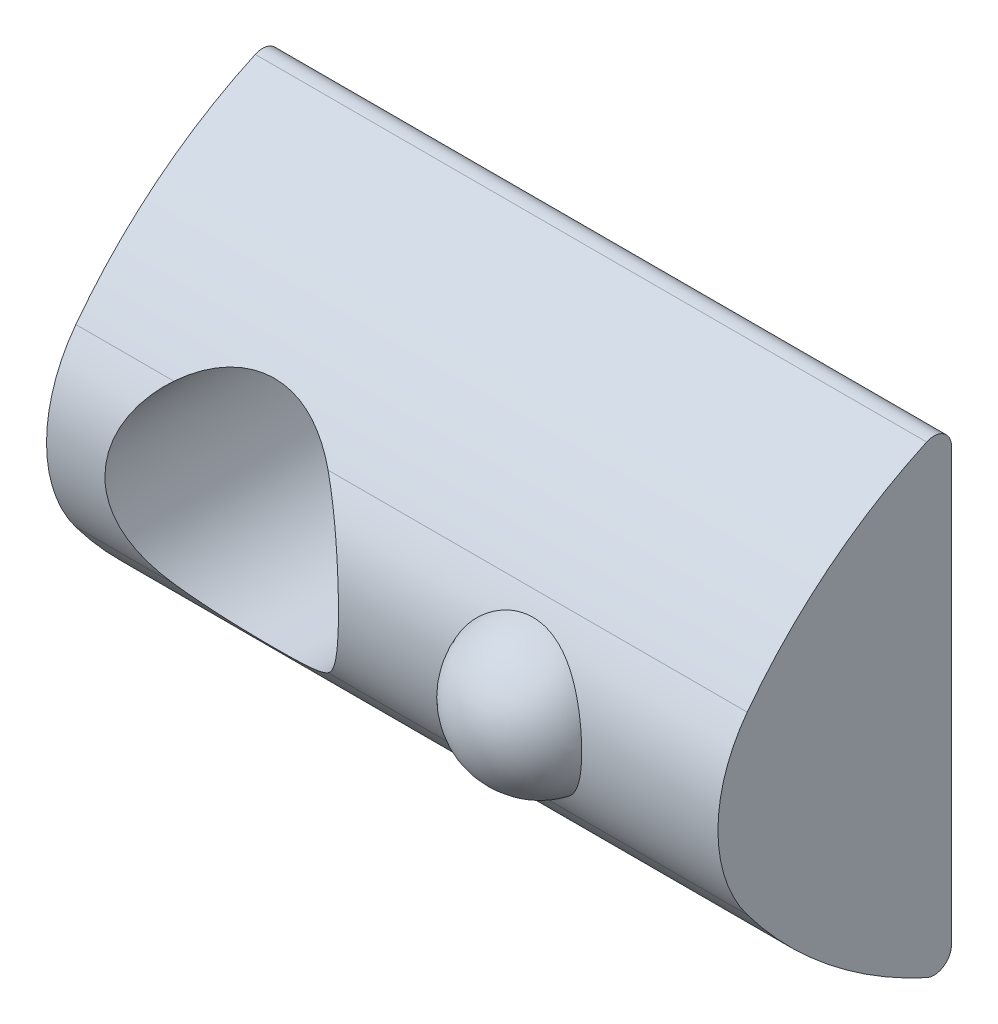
ISO-10303-21;
HEADER;
FILE_DESCRIPTION(('STEP AP214'),'2;1');
FILE_NAME('part.step','',(''),(''),'','','');
FILE_SCHEMA(('AUTOMOTIVE_DESIGN { 1 0 10303 214 1 1 1 1 }'));
ENDSEC;
DATA;
#1=APPLICATION_CONTEXT('core data for automotive mechanical design processes');
#2=APPLICATION_PROTOCOL_DEFINITION('international standard','automotive_design',2000,#1);
#3=PRODUCT_CONTEXT('',#1,'mechanical');
#4=PRODUCT('Part','Part','',(#3));
#5=PRODUCT_RELATED_PRODUCT_CATEGORY('part','',(#4));
#6=PRODUCT_DEFINITION_FORMATION('','',#4);
#7=PRODUCT_DEFINITION_CONTEXT('part definition',#1,'design');
#8=PRODUCT_DEFINITION('design','',#6,#7);
#9=PRODUCT_DEFINITION_SHAPE('','',#8);
#10=(LENGTH_UNIT() NAMED_UNIT(*) SI_UNIT(.MILLI.,.METRE.));
#11=(NAMED_UNIT(*) PLANE_ANGLE_UNIT() SI_UNIT($,.RADIAN.));
#12=(NAMED_UNIT(*) SI_UNIT($,.STERADIAN.) SOLID_ANGLE_UNIT());
#13=UNCERTAINTY_MEASURE_WITH_UNIT(LENGTH_MEASURE(1.E-05),#10,'distance_accuracy_value','');
#14=(GEOMETRIC_REPRESENTATION_CONTEXT(3) GLOBAL_UNCERTAINTY_ASSIGNED_CONTEXT((#13)) GLOBAL_UNIT_ASSIGNED_CONTEXT((#10,
#11,#12)) REPRESENTATION_CONTEXT('',''));
#15=CARTESIAN_POINT('',(0.,0.,0.));
#16=DIRECTION('',(0.,0.,1.));
#17=DIRECTION('',(1.,0.,0.));
#18=AXIS2_PLACEMENT_3D('',#15,#16,#17);
#19=CARTESIAN_POINT('',(-6.5,0.,1.50000071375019));
#20=DIRECTION('',(1.,0.,0.));
#21=DIRECTION('',(0.,0.,1.));
#22=AXIS2_PLACEMENT_3D('',#19,#20,#21);
#23=CYLINDRICAL_SURFACE('',#22,2.49999928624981);
#24=DIRECTION('',(1.,0.,0.));
#25=VECTOR('',#24,1.);
#26=CARTESIAN_POINT('',(-6.5,1.50268008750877,3.497986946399));
#27=LINE('',#26,#25);
#28=CARTESIAN_POINT('',(1.31983050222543,1.50268008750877,3.497986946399));
#29=VERTEX_POINT('',#28);
#30=CARTESIAN_POINT('',(8.5,1.50268008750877,3.497986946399));
#31=VERTEX_POINT('',#30);
#32=EDGE_CURVE('E104',#29,#31,#27,.T.);
#33=ORIENTED_EDGE('',*,*,#32,.F.);
#34=CARTESIAN_POINT('',(1.31983050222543,1.50268008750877,3.497986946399));
#35=CARTESIAN_POINT('',(1.36032086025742,1.46710021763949,3.52474503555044));
#36=CARTESIAN_POINT('',(1.39945364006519,1.42984354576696,3.55127739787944));
#37=CARTESIAN_POINT('',(1.47489622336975,1.351902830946,3.60346503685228));
#38=CARTESIAN_POINT('',(1.51120257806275,1.31121472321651,3.62911922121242));
#39=CARTESIAN_POINT('',(1.61601232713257,1.18349795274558,3.70433937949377));
#40=CARTESIAN_POINT('',(1.67989665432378,1.09126017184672,3.75181725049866));
#41=CARTESIAN_POINT('',(1.78282845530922,0.911219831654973,3.82971285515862));
#42=CARTESIAN_POINT('',(1.8242638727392,0.825443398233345,3.86166171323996));
#43=CARTESIAN_POINT('',(1.89502792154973,0.646585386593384,3.91674082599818));
#44=CARTESIAN_POINT('',(1.92439204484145,0.553526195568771,3.93989691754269));
#45=CARTESIAN_POINT('',(1.96957083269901,0.361380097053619,3.97568510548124));
#46=CARTESIAN_POINT('',(1.98527991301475,0.262252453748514,3.98823517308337));
#47=CARTESIAN_POINT('',(2.00156263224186,0.0619180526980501,4.00124510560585));
#48=CARTESIAN_POINT('',(2.00213442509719,-0.0392889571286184,4.00170349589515));
#49=CARTESIAN_POINT('',(1.98891129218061,-0.228443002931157,3.99113584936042));
#50=CARTESIAN_POINT('',(1.97674695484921,-0.316586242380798,3.9814132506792));
#51=CARTESIAN_POINT('',(1.94127311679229,-0.489092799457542,3.95324794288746));
#52=CARTESIAN_POINT('',(1.91796664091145,-0.573457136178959,3.93480760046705));
#53=CARTESIAN_POINT('',(1.86053007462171,-0.739162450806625,3.88982052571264));
#54=CARTESIAN_POINT('',(1.82608970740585,-0.820331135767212,3.86304233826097));
#55=CARTESIAN_POINT('',(1.74800273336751,-0.975737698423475,3.80323410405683));
#56=CARTESIAN_POINT('',(1.70434135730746,-1.0499641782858,3.77019403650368));
#57=CARTESIAN_POINT('',(1.60805607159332,-1.19236225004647,3.69880738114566));
#58=CARTESIAN_POINT('',(1.55525046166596,-1.26035713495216,3.66035695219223));
#59=CARTESIAN_POINT('',(1.44260174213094,-1.38782764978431,3.58076495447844));
#60=CARTESIAN_POINT('',(1.38279254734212,-1.44734147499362,3.5396367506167));
#61=CARTESIAN_POINT('',(1.31983050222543,-1.50268008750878,3.497986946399));
#62=B_SPLINE_CURVE_WITH_KNOTS('',3,(#34,#35,#36,#37,#38,#39,#40,#41,#42,#43,#44,#45,#46,#47,#48,
#49,#50,#51,#52,#53,#54,#55,#56,#57,#58,#59,#60,#61),.UNSPECIFIED.,.F.,.F.,(4,2,2,2,2,2,2,2,2,2,
2,2,2,4),(0.,0.180442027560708,0.361100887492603,0.724671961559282,1.02491253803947,
1.32426392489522,1.62590989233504,1.92759264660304,2.19487904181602,2.46209291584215,
2.73750905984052,3.0133697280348,3.29552205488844,3.57636055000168),.UNSPECIFIED.);
#63=CARTESIAN_POINT('',(1.31983050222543,-1.50268008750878,3.497986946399));
#64=VERTEX_POINT('',#63);
#65=EDGE_CURVE('E33',#29,#64,#62,.T.);
#66=ORIENTED_EDGE('',*,*,#65,.T.);
#67=DIRECTION('',(1.,0.,0.));
#68=VECTOR('',#67,1.);
#69=CARTESIAN_POINT('',(-6.5,-1.50268008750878,3.497986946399));
#70=LINE('',#69,#68);
#71=CARTESIAN_POINT('',(8.5,-1.50268008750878,3.497986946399));
#72=VERTEX_POINT('',#71);
#73=EDGE_CURVE('E103',#64,#72,#70,.T.);
#74=ORIENTED_EDGE('',*,*,#73,.T.);
#75=CARTESIAN_POINT('',(8.5,0.,1.50000071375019));
#76=DIRECTION('',(-1.,0.,0.));
#77=DIRECTION('',(0.,0.,-1.));
#78=AXIS2_PLACEMENT_3D('',#75,#76,#77);
#79=CIRCLE('',#78,2.49999928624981);
#80=EDGE_CURVE('E115',#72,#31,#79,.T.);
#81=ORIENTED_EDGE('',*,*,#80,.T.);
#82=EDGE_LOOP('',(#33,#66,#74,#81));
#83=FACE_BOUND('',#82,.T.);
#84=CARTESIAN_POINT('',(3.83380961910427,0.,4.00000000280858));
#85=CARTESIAN_POINT('',(3.83381173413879,-0.069863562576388,3.99999625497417));
#86=CARTESIAN_POINT('',(3.83896952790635,-0.139786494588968,3.99704452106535));
#87=CARTESIAN_POINT('',(3.8595455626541,-0.277693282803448,3.98549605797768));
#88=CARTESIAN_POINT('',(3.87497811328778,-0.345674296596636,3.97689145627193));
#89=CARTESIAN_POINT('',(3.9158759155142,-0.477654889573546,3.95485558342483));
#90=CARTESIAN_POINT('',(3.94133160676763,-0.541658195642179,3.94142891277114));
#91=CARTESIAN_POINT('',(4.00191588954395,-0.663979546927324,3.91103821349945));
#92=CARTESIAN_POINT('',(4.0370429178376,-0.722298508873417,3.89407475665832));
#93=CARTESIAN_POINT('',(4.1166880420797,-0.831992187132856,3.85820678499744));
#94=CARTESIAN_POINT('',(4.16125713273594,-0.883326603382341,3.83929202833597));
#95=CARTESIAN_POINT('',(4.25894691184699,-0.977217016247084,3.80165360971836));
#96=CARTESIAN_POINT('',(4.31206779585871,-1.01977281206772,3.78292995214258));
#97=CARTESIAN_POINT('',(4.4242005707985,-1.09373829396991,3.74841316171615));
#98=CARTESIAN_POINT('',(4.48300967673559,-1.12542292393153,3.73255346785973));
#99=CARTESIAN_POINT('',(4.60616471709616,-1.17812160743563,3.70520283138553));
#100=CARTESIAN_POINT('',(4.67050616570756,-1.1991442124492,3.69370838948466));
#101=CARTESIAN_POINT('',(4.79674874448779,-1.22833870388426,3.67748447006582));
#102=CARTESIAN_POINT('',(4.85835873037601,-1.23748645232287,3.6722446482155));
#103=CARTESIAN_POINT('',(4.98245984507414,-1.24590177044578,3.66743057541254));
#104=CARTESIAN_POINT('',(5.04495055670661,-1.24517387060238,3.66785372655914));
#105=CARTESIAN_POINT('',(5.1642800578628,-1.2342849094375,3.67406789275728));
#106=CARTESIAN_POINT('',(5.22120321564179,-1.22480284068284,3.67947248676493));
#107=CARTESIAN_POINT('',(5.33247747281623,-1.19767062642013,3.69449830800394));
#108=CARTESIAN_POINT('',(5.38682836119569,-1.18001981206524,3.7041198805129));
#109=CARTESIAN_POINT('',(5.49292557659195,-1.13654941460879,3.72685129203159));
#110=CARTESIAN_POINT('',(5.54457951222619,-1.11054595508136,3.74003847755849));
#111=CARTESIAN_POINT('',(5.64284138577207,-1.05119703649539,3.76849408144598));
#112=CARTESIAN_POINT('',(5.68944764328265,-1.01784914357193,3.78376318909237));
#113=CARTESIAN_POINT('',(5.7807539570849,-0.941322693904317,3.81641683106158));
#114=CARTESIAN_POINT('',(5.82491950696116,-0.897535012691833,3.83386894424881));
#115=CARTESIAN_POINT('',(5.90573718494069,-0.803230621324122,3.86798126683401));
#116=CARTESIAN_POINT('',(5.94238655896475,-0.752711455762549,3.88464118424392));
#117=CARTESIAN_POINT('',(6.0100728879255,-0.642228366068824,3.91683335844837));
#118=CARTESIAN_POINT('',(6.04050793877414,-0.581844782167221,3.9321955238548));
#119=CARTESIAN_POINT('',(6.09175506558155,-0.456281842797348,3.95884657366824));
#120=CARTESIAN_POINT('',(6.11256610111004,-0.391101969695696,3.97013501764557));
#121=CARTESIAN_POINT('',(6.1445393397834,-0.256614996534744,3.98773385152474));
#122=CARTESIAN_POINT('',(6.15553806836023,-0.187257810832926,3.9939597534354));
#123=CARTESIAN_POINT('',(6.16713711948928,-0.0474061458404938,4.00053049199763));
#124=CARTESIAN_POINT('',(6.1677378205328,0.0230882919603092,4.00087554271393));
#125=CARTESIAN_POINT('',(6.15857558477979,0.162543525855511,3.99567738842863));
#126=CARTESIAN_POINT('',(6.14890521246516,0.231512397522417,3.99018677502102));
#127=CARTESIAN_POINT('',(6.11948257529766,0.366614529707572,3.97390871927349));
#128=CARTESIAN_POINT('',(6.09973004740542,0.432747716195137,3.96312113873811));
#129=CARTESIAN_POINT('',(6.05033743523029,0.560562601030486,3.9372190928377));
#130=CARTESIAN_POINT('',(6.02066520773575,0.622229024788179,3.92209058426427));
#131=CARTESIAN_POINT('',(5.95185948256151,0.7392084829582,3.8889890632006));
#132=CARTESIAN_POINT('',(5.91272449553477,0.794520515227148,3.87101560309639));
#133=CARTESIAN_POINT('',(5.82533093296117,0.897567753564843,3.83396437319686));
#134=CARTESIAN_POINT('',(5.77702203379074,0.945258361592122,3.81488093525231));
#135=CARTESIAN_POINT('',(5.67228326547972,1.03128393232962,3.77786109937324));
#136=CARTESIAN_POINT('',(5.61585480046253,1.06962050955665,3.75992450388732));
#137=CARTESIAN_POINT('',(5.4986746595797,1.13429301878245,3.72814473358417));
#138=CARTESIAN_POINT('',(5.438201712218,1.16106303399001,3.71416195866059));
#139=CARTESIAN_POINT('',(5.31268810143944,1.20387429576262,3.69118362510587));
#140=CARTESIAN_POINT('',(5.24765137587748,1.21992466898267,3.68218382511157));
#141=CARTESIAN_POINT('',(5.12152058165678,1.23967714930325,3.67101712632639));
#142=CARTESIAN_POINT('',(5.06063602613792,1.2444042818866,3.66828409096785));
#143=CARTESIAN_POINT('',(4.93887808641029,1.24437598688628,3.6683010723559));
#144=CARTESIAN_POINT('',(4.87800470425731,1.23962337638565,3.67104946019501));
#145=CARTESIAN_POINT('',(4.76145399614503,1.22133099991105,3.68138694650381));
#146=CARTESIAN_POINT('',(4.70567393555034,1.20828190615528,3.68870535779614));
#147=CARTESIAN_POINT('',(4.59725214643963,1.17427240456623,3.70713736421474));
#148=CARTESIAN_POINT('',(4.54461088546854,1.15331082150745,3.71825152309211));
#149=CARTESIAN_POINT('',(4.44139328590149,1.10296798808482,3.74372175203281));
#150=CARTESIAN_POINT('',(4.39100675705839,1.07325977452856,3.75819794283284));
#151=CARTESIAN_POINT('',(4.29580517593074,1.00660329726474,3.78868761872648));
#152=CARTESIAN_POINT('',(4.25099190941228,0.969652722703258,3.80470159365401));
#153=CARTESIAN_POINT('',(4.16376798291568,0.885649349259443,3.83834353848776));
#154=CARTESIAN_POINT('',(4.12195481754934,0.837980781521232,3.85598480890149));
#155=CARTESIAN_POINT('',(4.04635018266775,0.736156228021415,3.889759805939));
#156=CARTESIAN_POINT('',(4.0125636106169,0.681996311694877,3.90589260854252));
#157=CARTESIAN_POINT('',(3.95163708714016,0.56498408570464,3.93611650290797));
#158=CARTESIAN_POINT('',(3.92503725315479,0.501801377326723,3.95001968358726));
#159=CARTESIAN_POINT('',(3.88179939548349,0.371371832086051,3.97314681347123));
#160=CARTESIAN_POINT('',(3.86514813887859,0.304130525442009,3.98237697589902));
#161=CARTESIAN_POINT('',(3.84699220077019,0.196992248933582,3.99253386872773));
#162=CARTESIAN_POINT('',(3.8420521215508,0.157815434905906,3.99532493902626));
#163=CARTESIAN_POINT('',(3.83546022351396,0.0790987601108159,3.99905907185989));
#164=CARTESIAN_POINT('',(3.83380842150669,0.03955889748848,4.00000212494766));
#165=CARTESIAN_POINT('',(3.83380961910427,0.,4.00000000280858));
#166=B_SPLINE_CURVE_WITH_KNOTS('',3,(#84,#85,#86,#87,#88,#89,#90,#91,#92,#93,#94,#95,#96,#97,
#98,#99,#100,#101,#102,#103,#104,#105,#106,#107,#108,#109,#110,#111,#112,#113,#114,#115,#116,
#117,#118,#119,#120,#121,#122,#123,#124,#125,#126,#127,#128,#129,#130,#131,#132,#133,#134,#135,
#136,#137,#138,#139,#140,#141,#142,#143,#144,#145,#146,#147,#148,#149,#150,#151,#152,#153,#154,
#155,#156,#157,#158,#159,#160,#161,#162,#163,#164,#165),.UNSPECIFIED.,.T.,.F.,(4,2,2,2,2,2,2,2,
2,2,2,2,2,2,2,2,2,2,2,2,2,2,2,2,2,2,2,2,2,2,2,2,2,2,2,2,2,2,2,2,4),(0.,0.209444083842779,
0.419180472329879,0.628717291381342,0.838220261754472,1.04888495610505,1.25955446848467,
1.46441600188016,1.66911296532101,1.85562181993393,2.04204511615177,2.2151235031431,
2.38821606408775,2.56541542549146,2.74267359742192,2.93563265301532,3.1286622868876,
3.33572832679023,3.54281674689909,3.75329412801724,3.96376384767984,4.17235274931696,
4.38094709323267,4.59022401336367,4.79953389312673,5.01002696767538,5.22048368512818,
5.42215672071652,5.6236578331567,5.80608575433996,5.98845947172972,6.160939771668,
6.33344569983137,6.51346537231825,6.69354257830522,6.89013872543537,7.0868545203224,
7.29573311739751,7.50433325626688,7.6229263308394,7.74152001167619),.UNSPECIFIED.);
#167=CARTESIAN_POINT('',(3.83380961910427,0.,4.00000000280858));
#168=VERTEX_POINT('',#167);
#169=EDGE_CURVE('E9',#168,#168,#166,.T.);
#170=ORIENTED_EDGE('',*,*,#169,.F.);
#171=EDGE_LOOP('',(#170));
#172=FACE_BOUND('',#171,.T.);
#173=ADVANCED_FACE('F14',(#83,#172),#23,.T.);
#174=CARTESIAN_POINT('',(-3.,-1.50268008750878,3.497986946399));
#175=VERTEX_POINT('',#174);
#176=CARTESIAN_POINT('',(-1.31983050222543,-1.50268008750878,3.497986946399));
#177=VERTEX_POINT('',#176);
#178=EDGE_CURVE('E26',#175,#177,#70,.T.);
#179=ORIENTED_EDGE('',*,*,#178,.T.);
#180=CARTESIAN_POINT('',(-1.31983050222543,-1.50268008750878,3.497986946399));
#181=CARTESIAN_POINT('',(-1.36030900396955,-1.46711035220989,3.52473718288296));
#182=CARTESIAN_POINT('',(-1.39943066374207,-1.42986528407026,3.55126180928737));
#183=CARTESIAN_POINT('',(-1.47485329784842,-1.35194918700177,3.60343503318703));
#184=CARTESIAN_POINT('',(-1.51115078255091,-1.31127404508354,3.62908252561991));
#185=CARTESIAN_POINT('',(-1.61597606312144,-1.18354975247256,3.70431239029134));
#186=CARTESIAN_POINT('',(-1.67988082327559,-1.09128510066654,3.751805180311));
#187=CARTESIAN_POINT('',(-1.7828518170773,-0.911181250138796,3.82973060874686));
#188=CARTESIAN_POINT('',(-1.82430519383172,-0.825365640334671,3.86169382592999));
#189=CARTESIAN_POINT('',(-1.89505835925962,-0.646481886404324,3.91676456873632));
#190=CARTESIAN_POINT('',(-1.92440572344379,-0.553443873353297,3.93990673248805));
#191=CARTESIAN_POINT('',(-1.96432997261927,-0.383688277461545,3.9715343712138));
#192=CARTESIAN_POINT('',(-1.9776431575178,-0.308002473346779,3.98214500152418));
#193=CARTESIAN_POINT('',(-1.99548318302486,-0.154887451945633,3.99638217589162));
#194=CARTESIAN_POINT('',(-2.00000407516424,-0.0774570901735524,4.00000399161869));
#195=CARTESIAN_POINT('',(-1.99999494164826,0.0961446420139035,3.99999504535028));
#196=CARTESIAN_POINT('',(-1.99301810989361,0.19233046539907,3.99440368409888));
#197=CARTESIAN_POINT('',(-1.96561053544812,0.381480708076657,3.97256125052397));
#198=CARTESIAN_POINT('',(-1.94517544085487,0.474444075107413,3.95630673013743));
#199=CARTESIAN_POINT('',(-1.89234936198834,0.654007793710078,3.91468867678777));
#200=CARTESIAN_POINT('',(-1.86003534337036,0.740644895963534,3.88938381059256));
#201=CARTESIAN_POINT('',(-1.78496525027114,0.906768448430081,3.83142423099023));
#202=CARTESIAN_POINT('',(-1.74218828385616,0.986240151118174,3.7987548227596));
#203=CARTESIAN_POINT('',(-1.64229622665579,1.14574859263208,3.72393391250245));
#204=CARTESIAN_POINT('',(-1.58409445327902,1.22478527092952,3.68112248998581));
#205=CARTESIAN_POINT('',(-1.45849934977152,1.37187100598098,3.59174232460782));
#206=CARTESIAN_POINT('',(-1.39116147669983,1.43998132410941,3.54519689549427));
#207=CARTESIAN_POINT('',(-1.31983050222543,1.50268008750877,3.497986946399));
#208=B_SPLINE_CURVE_WITH_KNOTS('',3,(#180,#181,#182,#183,#184,#185,#186,#187,#188,#189,#190,
#191,#192,#193,#194,#195,#196,#197,#198,#199,#200,#201,#202,#203,#204,#205,#206,#207),
.UNSPECIFIED.,.F.,.F.,(4,2,2,2,2,2,2,2,2,2,2,2,2,4),(0.,0.180389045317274,0.360997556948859,
0.724671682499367,1.02506370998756,1.32426371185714,1.55621608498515,1.78832533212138,
2.0764340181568,2.36463591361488,2.65100249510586,2.93794561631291,3.25811361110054,
3.57641852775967),.UNSPECIFIED.);
#209=CARTESIAN_POINT('',(-1.31983050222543,1.50268008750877,3.497986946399));
#210=VERTEX_POINT('',#209);
#211=EDGE_CURVE('E84',#177,#210,#208,.T.);
#212=ORIENTED_EDGE('',*,*,#211,.T.);
#213=CARTESIAN_POINT('',(-3.,1.50268008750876,3.497986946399));
#214=VERTEX_POINT('',#213);
#215=EDGE_CURVE('E88',#214,#210,#27,.T.);
#216=ORIENTED_EDGE('',*,*,#215,.F.);
#217=CARTESIAN_POINT('',(-3.,0.,1.50000071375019));
#218=DIRECTION('',(-1.,0.,0.));
#219=DIRECTION('',(0.,0.,-1.));
#220=AXIS2_PLACEMENT_3D('',#217,#218,#219);
#221=CIRCLE('',#220,2.49999928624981);
#222=EDGE_CURVE('E133',#175,#214,#221,.T.);
#223=ORIENTED_EDGE('',*,*,#222,.F.);
#224=EDGE_LOOP('',(#179,#212,#216,#223));
#225=FACE_BOUND('',#224,.T.);
#226=ADVANCED_FACE('F85',(#225),#23,.T.);
#227=CARTESIAN_POINT('',(-6.5,3.30589756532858,-2.89557082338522));
#228=DIRECTION('',(1.,0.,0.));
#229=DIRECTION('',(0.,0.,1.));
#230=AXIS2_PLACEMENT_3D('',#227,#228,#229);
#231=CYLINDRICAL_SURFACE('',#230,7.99999999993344);
#232=CARTESIAN_POINT('',(-1.31983050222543,-1.50268008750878,3.497986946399));
#233=CARTESIAN_POINT('',(-1.24568060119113,-1.56782204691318,3.44903505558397));
#234=CARTESIAN_POINT('',(-1.16568213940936,-1.62833540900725,3.40191910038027));
#235=CARTESIAN_POINT('',(-0.994263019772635,-1.73835993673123,3.31412623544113));
#236=CARTESIAN_POINT('',(-0.902757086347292,-1.78778036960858,3.27350315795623));
#237=CARTESIAN_POINT('',(-0.725379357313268,-1.86591178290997,3.20808255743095));
#238=CARTESIAN_POINT('',(-0.64098395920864,-1.89667827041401,3.18178879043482));
#239=CARTESIAN_POINT('',(-0.466831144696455,-1.94685471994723,3.13847385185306));
#240=CARTESIAN_POINT('',(-0.377091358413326,-1.96629996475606,3.12142388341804));
#241=CARTESIAN_POINT('',(-0.193711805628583,-1.99276356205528,3.0981358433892));
#242=CARTESIAN_POINT('',(-0.100049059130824,-1.99969360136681,3.0919746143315));
#243=CARTESIAN_POINT('',(0.087344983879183,-2.00028622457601,3.09144979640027));
#244=CARTESIAN_POINT('',(0.181076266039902,-1.9939510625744,3.09708420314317));
#245=CARTESIAN_POINT('',(0.356540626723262,-1.96976476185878,3.11837962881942));
#246=CARTESIAN_POINT('',(0.438564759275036,-1.95307100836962,3.13303186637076));
#247=CARTESIAN_POINT('',(0.598415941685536,-1.91017517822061,3.17018506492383));
#248=CARTESIAN_POINT('',(0.676231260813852,-1.88394795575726,3.19270677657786));
#249=CARTESIAN_POINT('',(0.858738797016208,-1.80997916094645,3.25512018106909));
#250=CARTESIAN_POINT('',(0.960497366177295,-1.75783865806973,3.2983114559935));
#251=CARTESIAN_POINT('',(1.1504427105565,-1.63979759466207,3.39298582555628));
#252=CARTESIAN_POINT('',(1.23871143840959,-1.57398636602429,3.44441461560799));
#253=CARTESIAN_POINT('',(1.31983050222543,-1.50268008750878,3.497986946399));
#254=B_SPLINE_CURVE_WITH_KNOTS('',3,(#232,#233,#234,#235,#236,#237,#238,#239,#240,#241,#242,
#243,#244,#245,#246,#247,#248,#249,#250,#251,#252,#253),.UNSPECIFIED.,.F.,.F.,(4,2,2,2,2,2,2,2,
2,2,4),(0.,0.330869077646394,0.664353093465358,0.943984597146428,1.22273989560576,
1.50345464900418,1.7841217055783,2.03798878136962,2.29253038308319,2.65717422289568,
3.01950628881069),.UNSPECIFIED.);
#255=EDGE_CURVE('E91',#177,#64,#254,.T.);
#256=ORIENTED_EDGE('',*,*,#255,.F.);
#257=ORIENTED_EDGE('',*,*,#178,.F.);
#258=CARTESIAN_POINT('',(-3.,3.30589756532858,-2.89557082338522));
#259=DIRECTION('',(-1.,0.,0.));
#260=DIRECTION('',(0.,0.,-1.));
#261=AXIS2_PLACEMENT_3D('',#258,#259,#260);
#262=CIRCLE('',#261,7.99999999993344);
#263=CARTESIAN_POINT('',(-3.,-3.97264015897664,0.424502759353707));
#264=VERTEX_POINT('',#263);
#265=EDGE_CURVE('E135',#264,#175,#262,.T.);
#266=ORIENTED_EDGE('',*,*,#265,.F.);
#267=DIRECTION('',(1.,0.,0.));
#268=VECTOR('',#267,1.);
#269=CARTESIAN_POINT('',(-6.5,-3.97264015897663,0.424502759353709));
#270=LINE('',#269,#268);
#271=CARTESIAN_POINT('',(8.5,-3.97264015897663,0.424502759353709));
#272=VERTEX_POINT('',#271);
#273=EDGE_CURVE('E113',#264,#272,#270,.T.);
#274=ORIENTED_EDGE('',*,*,#273,.T.);
#275=CARTESIAN_POINT('',(8.5,3.30589756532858,-2.89557082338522));
#276=DIRECTION('',(1.,0.,0.));
#277=DIRECTION('',(0.,0.,1.));
#278=AXIS2_PLACEMENT_3D('',#275,#276,#277);
#279=CIRCLE('',#278,7.99999999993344);
#280=EDGE_CURVE('E130',#72,#272,#279,.T.);
#281=ORIENTED_EDGE('',*,*,#280,.F.);
#282=ORIENTED_EDGE('',*,*,#73,.F.);
#283=EDGE_LOOP('',(#256,#257,#266,#274,#281,#282));
#284=FACE_BOUND('',#283,.T.);
#285=ADVANCED_FACE('F154',(#284),#231,.T.);
#286=CARTESIAN_POINT('',(-6.5,-3.30589756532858,-2.89557082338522));
#287=DIRECTION('',(1.,0.,0.));
#288=DIRECTION('',(0.,0.,1.));
#289=AXIS2_PLACEMENT_3D('',#286,#287,#288);
#290=CYLINDRICAL_SURFACE('',#289,7.99999999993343);
#291=ORIENTED_EDGE('',*,*,#215,.T.);
#292=CARTESIAN_POINT('',(-1.31983050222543,1.50268008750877,3.497986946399));
#293=CARTESIAN_POINT('',(-1.24568060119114,1.56782204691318,3.44903505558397));
#294=CARTESIAN_POINT('',(-1.16568213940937,1.62833540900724,3.40191910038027));
#295=CARTESIAN_POINT('',(-0.994263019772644,1.73835993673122,3.31412623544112));
#296=CARTESIAN_POINT('',(-0.902757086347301,1.78778036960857,3.27350315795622));
#297=CARTESIAN_POINT('',(-0.725379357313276,1.86591178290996,3.20808255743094));
#298=CARTESIAN_POINT('',(-0.640983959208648,1.896678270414,3.18178879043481));
#299=CARTESIAN_POINT('',(-0.466831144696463,1.94685471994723,3.13847385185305));
#300=CARTESIAN_POINT('',(-0.377091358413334,1.96629996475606,3.12142388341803));
#301=CARTESIAN_POINT('',(-0.193711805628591,1.99276356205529,3.09813584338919));
#302=CARTESIAN_POINT('',(-0.100049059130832,1.99969360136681,3.09197461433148));
#303=CARTESIAN_POINT('',(0.087344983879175,2.00028622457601,3.09144979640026));
#304=CARTESIAN_POINT('',(0.181076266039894,1.9939510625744,3.09708420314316));
#305=CARTESIAN_POINT('',(0.356540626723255,1.96976476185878,3.11837962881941));
#306=CARTESIAN_POINT('',(0.43856475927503,1.95307100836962,3.13303186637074));
#307=CARTESIAN_POINT('',(0.598415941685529,1.91017517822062,3.17018506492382));
#308=CARTESIAN_POINT('',(0.676231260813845,1.88394795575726,3.19270677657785));
#309=CARTESIAN_POINT('',(0.858738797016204,1.80997916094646,3.25512018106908));
#310=CARTESIAN_POINT('',(0.960497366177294,1.75783865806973,3.2983114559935));
#311=CARTESIAN_POINT('',(1.1504427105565,1.63979759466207,3.39298582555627));
#312=CARTESIAN_POINT('',(1.2387114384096,1.57398636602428,3.44441461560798));
#313=CARTESIAN_POINT('',(1.31983050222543,1.50268008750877,3.497986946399));
#314=B_SPLINE_CURVE_WITH_KNOTS('',3,(#292,#293,#294,#295,#296,#297,#298,#299,#300,#301,#302,
#303,#304,#305,#306,#307,#308,#309,#310,#311,#312,#313),.UNSPECIFIED.,.F.,.F.,(4,2,2,2,2,2,2,2,
2,2,4),(0.,0.330869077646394,0.66435309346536,0.943984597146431,1.22273989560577,
1.50345464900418,1.7841217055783,2.03798878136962,2.2925303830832,2.65717422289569,
3.01950628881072),.UNSPECIFIED.);
#315=EDGE_CURVE('E93',#210,#29,#314,.T.);
#316=ORIENTED_EDGE('',*,*,#315,.T.);
#317=ORIENTED_EDGE('',*,*,#32,.T.);
#318=CARTESIAN_POINT('',(8.5,-3.30589756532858,-2.89557082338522));
#319=DIRECTION('',(-1.,0.,0.));
#320=DIRECTION('',(0.,0.,-1.));
#321=AXIS2_PLACEMENT_3D('',#318,#319,#320);
#322=CIRCLE('',#321,7.99999999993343);
#323=CARTESIAN_POINT('',(8.5,3.97264015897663,0.424502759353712));
#324=VERTEX_POINT('',#323);
#325=EDGE_CURVE('E118',#31,#324,#322,.T.);
#326=ORIENTED_EDGE('',*,*,#325,.T.);
#327=DIRECTION('',(1.,0.,0.));
#328=VECTOR('',#327,1.);
#329=CARTESIAN_POINT('',(-6.5,3.97264015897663,0.424502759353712));
#330=LINE('',#329,#328);
#331=CARTESIAN_POINT('',(-3.,3.97264015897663,0.424502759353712));
#332=VERTEX_POINT('',#331);
#333=EDGE_CURVE('E106',#332,#324,#330,.T.);
#334=ORIENTED_EDGE('',*,*,#333,.F.);
#335=CARTESIAN_POINT('',(-3.,-3.30589756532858,-2.89557082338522));
#336=DIRECTION('',(-1.,0.,0.));
#337=DIRECTION('',(0.,0.,-1.));
#338=AXIS2_PLACEMENT_3D('',#335,#336,#337);
#339=CIRCLE('',#338,7.99999999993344);
#340=EDGE_CURVE('E102',#214,#332,#339,.T.);
#341=ORIENTED_EDGE('',*,*,#340,.F.);
#342=EDGE_LOOP('',(#291,#316,#317,#326,#334,#341));
#343=FACE_BOUND('',#342,.T.);
#344=ADVANCED_FACE('F100',(#343),#290,.T.);
#345=CARTESIAN_POINT('',(-6.5,3.69969499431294,0.299999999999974));
#346=DIRECTION('',(1.,0.,0.));
#347=DIRECTION('',(0.,0.,1.));
#348=AXIS2_PLACEMENT_3D('',#345,#346,#347);
#349=CYLINDRICAL_SURFACE('',#348,0.299999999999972);
#350=CARTESIAN_POINT('',(-3.,3.69969499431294,0.299999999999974));
#351=DIRECTION('',(-1.,0.,0.));
#352=DIRECTION('',(0.,0.,-1.));
#353=AXIS2_PLACEMENT_3D('',#350,#351,#352);
#354=CIRCLE('',#353,0.299999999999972);
#355=CARTESIAN_POINT('',(-3.,3.69969499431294,0.));
#356=VERTEX_POINT('',#355);
#357=EDGE_CURVE('E140',#332,#356,#354,.T.);
#358=ORIENTED_EDGE('',*,*,#357,.F.);
#359=ORIENTED_EDGE('',*,*,#333,.T.);
#360=CARTESIAN_POINT('',(8.5,3.69969499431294,0.299999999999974));
#361=DIRECTION('',(-1.,0.,0.));
#362=DIRECTION('',(0.,0.,-1.));
#363=AXIS2_PLACEMENT_3D('',#360,#361,#362);
#364=CIRCLE('',#363,0.299999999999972);
#365=CARTESIAN_POINT('',(8.5,3.69969499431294,0.));
#366=VERTEX_POINT('',#365);
#367=EDGE_CURVE('E121',#324,#366,#364,.T.);
#368=ORIENTED_EDGE('',*,*,#367,.T.);
#369=DIRECTION('',(1.,0.,0.));
#370=VECTOR('',#369,1.);
#371=CARTESIAN_POINT('',(-6.5,3.69969499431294,0.));
#372=LINE('',#371,#370);
#373=EDGE_CURVE('E109',#356,#366,#372,.T.);
#374=ORIENTED_EDGE('',*,*,#373,.F.);
#375=EDGE_LOOP('',(#358,#359,#368,#374));
#376=FACE_BOUND('',#375,.T.);
#377=ADVANCED_FACE('F193',(#376),#349,.T.);
#378=CARTESIAN_POINT('',(-6.5,3.69969499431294,0.));
#379=DIRECTION('',(0.,0.,1.));
#380=DIRECTION('',(0.,1.,0.));
#381=AXIS2_PLACEMENT_3D('',#378,#379,#380);
#382=PLANE('',#381);
#383=CARTESIAN_POINT('',(0.,0.,0.));
#384=DIRECTION('',(0.,0.,-1.));
#385=DIRECTION('',(-1.,0.,0.));
#386=AXIS2_PLACEMENT_3D('',#383,#384,#385);
#387=CIRCLE('',#386,2.);
#388=CARTESIAN_POINT('',(-2.,0.,0.));
#389=VERTEX_POINT('',#388);
#390=EDGE_CURVE('E97',#389,#389,#387,.T.);
#391=ORIENTED_EDGE('',*,*,#390,.F.);
#392=EDGE_LOOP('',(#391));
#393=FACE_BOUND('',#392,.T.);
#394=DIRECTION('',(0.,-1.,0.));
#395=VECTOR('',#394,1.);
#396=CARTESIAN_POINT('',(-3.,3.69969499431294,0.));
#397=LINE('',#396,#395);
#398=CARTESIAN_POINT('',(-3.,-3.69969499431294,0.));
#399=VERTEX_POINT('',#398);
#400=EDGE_CURVE('E41',#356,#399,#397,.T.);
#401=ORIENTED_EDGE('',*,*,#400,.F.);
#402=ORIENTED_EDGE('',*,*,#373,.T.);
#403=DIRECTION('',(0.,-1.,0.));
#404=VECTOR('',#403,1.);
#405=CARTESIAN_POINT('',(8.5,3.69969499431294,0.));
#406=LINE('',#405,#404);
#407=CARTESIAN_POINT('',(8.5,-3.69969499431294,0.));
#408=VERTEX_POINT('',#407);
#409=EDGE_CURVE('E124',#366,#408,#406,.T.);
#410=ORIENTED_EDGE('',*,*,#409,.T.);
#411=DIRECTION('',(1.,0.,0.));
#412=VECTOR('',#411,1.);
#413=CARTESIAN_POINT('',(-6.5,-3.69969499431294,0.));
#414=LINE('',#413,#412);
#415=EDGE_CURVE('E111',#399,#408,#414,.T.);
#416=ORIENTED_EDGE('',*,*,#415,.F.);
#417=EDGE_LOOP('',(#401,#402,#410,#416));
#418=FACE_BOUND('',#417,.T.);
#419=ADVANCED_FACE('F197',(#393,#418),#382,.F.);
#420=CARTESIAN_POINT('',(-6.5,-3.69969499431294,0.299999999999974));
#421=DIRECTION('',(1.,0.,0.));
#422=DIRECTION('',(0.,0.,1.));
#423=AXIS2_PLACEMENT_3D('',#420,#421,#422);
#424=CYLINDRICAL_SURFACE('',#423,0.299999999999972);
#425=ORIENTED_EDGE('',*,*,#273,.F.);
#426=CARTESIAN_POINT('',(-3.,-3.69969499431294,0.299999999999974));
#427=DIRECTION('',(-1.,0.,0.));
#428=DIRECTION('',(0.,0.,-1.));
#429=AXIS2_PLACEMENT_3D('',#426,#427,#428);
#430=CIRCLE('',#429,0.299999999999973);
#431=EDGE_CURVE('E137',#399,#264,#430,.T.);
#432=ORIENTED_EDGE('',*,*,#431,.F.);
#433=ORIENTED_EDGE('',*,*,#415,.T.);
#434=CARTESIAN_POINT('',(8.5,-3.69969499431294,0.299999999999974));
#435=DIRECTION('',(1.,0.,0.));
#436=DIRECTION('',(0.,0.,1.));
#437=AXIS2_PLACEMENT_3D('',#434,#435,#436);
#438=CIRCLE('',#437,0.299999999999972);
#439=EDGE_CURVE('E127',#272,#408,#438,.T.);
#440=ORIENTED_EDGE('',*,*,#439,.F.);
#441=EDGE_LOOP('',(#425,#432,#433,#440));
#442=FACE_BOUND('',#441,.T.);
#443=ADVANCED_FACE('F199',(#442),#424,.T.);
#444=CARTESIAN_POINT('',(8.5,3.30589756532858,-2.89557082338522));
#445=DIRECTION('',(1.,0.,0.));
#446=DIRECTION('',(0.,0.,1.));
#447=AXIS2_PLACEMENT_3D('',#444,#445,#446);
#448=PLANE('',#447);
#449=ORIENTED_EDGE('',*,*,#280,.T.);
#450=ORIENTED_EDGE('',*,*,#439,.T.);
#451=ORIENTED_EDGE('',*,*,#409,.F.);
#452=ORIENTED_EDGE('',*,*,#367,.F.);
#453=ORIENTED_EDGE('',*,*,#325,.F.);
#454=ORIENTED_EDGE('',*,*,#80,.F.);
#455=EDGE_LOOP('',(#449,#450,#451,#452,#453,#454));
#456=FACE_BOUND('',#455,.T.);
#457=ADVANCED_FACE('F188',(#456),#448,.T.);
#458=CARTESIAN_POINT('',(-3.,-3.30589756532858,-2.89557082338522));
#459=DIRECTION('',(-1.,0.,0.));
#460=DIRECTION('',(0.,0.,-1.));
#461=AXIS2_PLACEMENT_3D('',#458,#459,#460);
#462=PLANE('',#461);
#463=ORIENTED_EDGE('',*,*,#340,.T.);
#464=ORIENTED_EDGE('',*,*,#357,.T.);
#465=ORIENTED_EDGE('',*,*,#400,.T.);
#466=ORIENTED_EDGE('',*,*,#431,.T.);
#467=ORIENTED_EDGE('',*,*,#265,.T.);
#468=ORIENTED_EDGE('',*,*,#222,.T.);
#469=EDGE_LOOP('',(#463,#464,#465,#466,#467,#468));
#470=FACE_BOUND('',#469,.T.);
#471=ADVANCED_FACE('F162',(#470),#462,.T.);
#472=CARTESIAN_POINT('',(0.,0.,4.));
#473=DIRECTION('',(0.,0.,-1.));
#474=DIRECTION('',(-1.,0.,0.));
#475=AXIS2_PLACEMENT_3D('',#472,#473,#474);
#476=CYLINDRICAL_SURFACE('',#475,2.);
#477=ORIENTED_EDGE('',*,*,#390,.T.);
#478=EDGE_LOOP('',(#477));
#479=FACE_BOUND('',#478,.T.);
#480=ORIENTED_EDGE('',*,*,#65,.F.);
#481=ORIENTED_EDGE('',*,*,#315,.F.);
#482=ORIENTED_EDGE('',*,*,#211,.F.);
#483=ORIENTED_EDGE('',*,*,#255,.T.);
#484=EDGE_LOOP('',(#480,#481,#482,#483));
#485=FACE_BOUND('',#484,.T.);
#486=ADVANCED_FACE('F94',(#479,#485),#476,.F.);
#487=CARTESIAN_POINT('',(5.,0.,3.55));
#488=DIRECTION('',(0.,-1.,0.));
#489=DIRECTION('',(1.,0.,0.));
#490=AXIS2_PLACEMENT_3D('',#487,#488,#489);
#491=SPHERICAL_SURFACE('',#490,1.25);
#492=ORIENTED_EDGE('',*,*,#169,.T.);
#493=EDGE_LOOP('',(#492));
#494=FACE_BOUND('',#493,.T.);
#495=ADVANCED_FACE('F161',(#494),#491,.T.);
#496=CLOSED_SHELL('',(#173,#226,#285,#344,#377,#419,#443,#457,#471,#486,#495));
#497=MANIFOLD_SOLID_BREP('B1',#496);
#498=ADVANCED_BREP_SHAPE_REPRESENTATION('',(#18,#497),#14);
#499=SHAPE_DEFINITION_REPRESENTATION(#9,#498);
ENDSEC;
END-ISO-10303-21;
